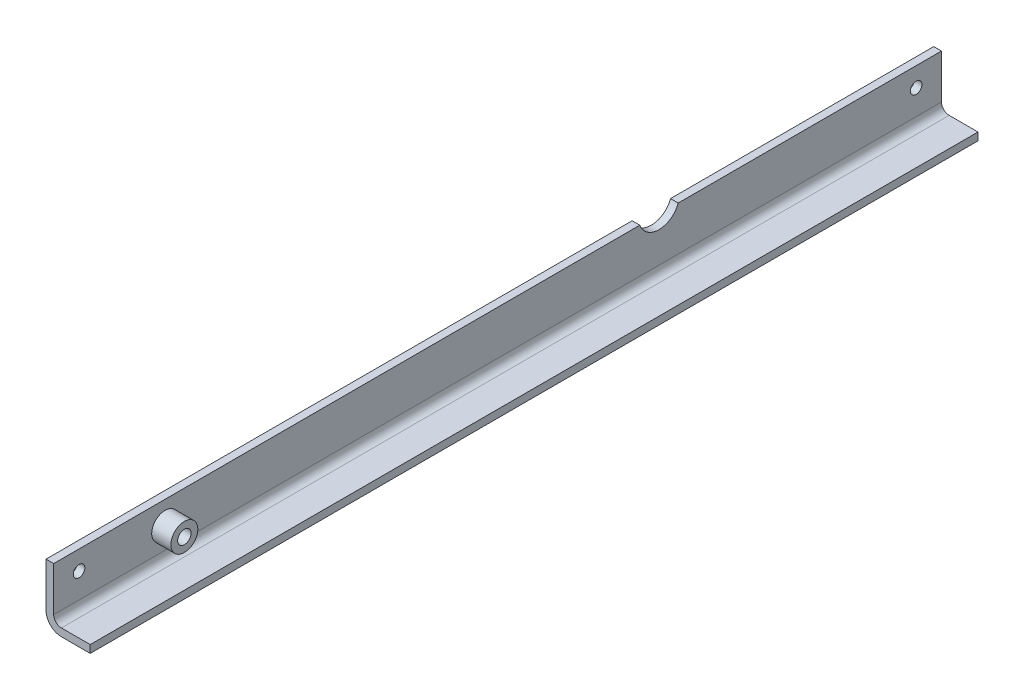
ISO-10303-21;
HEADER;
FILE_DESCRIPTION(('STEP AP214'),'2;1');
FILE_NAME('part.step','',(''),(''),'','','');
FILE_SCHEMA(('AUTOMOTIVE_DESIGN { 1 0 10303 214 1 1 1 1 }'));
ENDSEC;
DATA;
#1=APPLICATION_CONTEXT('core data for automotive mechanical design processes');
#2=APPLICATION_PROTOCOL_DEFINITION('international standard','automotive_design',2000,#1);
#3=PRODUCT_CONTEXT('',#1,'mechanical');
#4=PRODUCT('Part','Part','',(#3));
#5=PRODUCT_RELATED_PRODUCT_CATEGORY('part','',(#4));
#6=PRODUCT_DEFINITION_FORMATION('','',#4);
#7=PRODUCT_DEFINITION_CONTEXT('part definition',#1,'design');
#8=PRODUCT_DEFINITION('design','',#6,#7);
#9=PRODUCT_DEFINITION_SHAPE('','',#8);
#10=(LENGTH_UNIT() NAMED_UNIT(*) SI_UNIT(.MILLI.,.METRE.));
#11=(NAMED_UNIT(*) PLANE_ANGLE_UNIT() SI_UNIT($,.RADIAN.));
#12=(NAMED_UNIT(*) SI_UNIT($,.STERADIAN.) SOLID_ANGLE_UNIT());
#13=UNCERTAINTY_MEASURE_WITH_UNIT(LENGTH_MEASURE(1.E-05),#10,'distance_accuracy_value','');
#14=(GEOMETRIC_REPRESENTATION_CONTEXT(3) GLOBAL_UNCERTAINTY_ASSIGNED_CONTEXT((#13)) GLOBAL_UNIT_ASSIGNED_CONTEXT((#10,
#11,#12)) REPRESENTATION_CONTEXT('',''));
#15=CARTESIAN_POINT('',(0.,0.,0.));
#16=DIRECTION('',(0.,0.,1.));
#17=DIRECTION('',(1.,0.,0.));
#18=AXIS2_PLACEMENT_3D('',#15,#16,#17);
#19=CARTESIAN_POINT('',(4.00000000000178,8.00000000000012,-461.999999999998));
#20=DIRECTION('',(-0.999999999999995,0.,0.));
#21=DIRECTION('',(0.,0.,-0.999999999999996));
#22=AXIS2_PLACEMENT_3D('',#19,#20,#21);
#23=PLANE('',#22);
#24=DIRECTION('',(0.,0.,0.999999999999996));
#25=VECTOR('',#24,1.);
#26=CARTESIAN_POINT('',(4.00000000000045,31.0000000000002,-461.999999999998));
#27=LINE('',#26,#25);
#28=CARTESIAN_POINT('',(4.00000000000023,31.0000000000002,-304.999999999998));
#29=VERTEX_POINT('',#28);
#30=CARTESIAN_POINT('',(4.,31.,6.66133814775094E-13));
#31=VERTEX_POINT('',#30);
#32=EDGE_CURVE('E160',#29,#31,#27,.T.);
#33=ORIENTED_EDGE('',*,*,#32,.T.);
#34=DIRECTION('',(0.,1.,0.));
#35=VECTOR('',#34,1.);
#36=CARTESIAN_POINT('',(4.,7.99999999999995,8.88178419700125E-13));
#37=LINE('',#36,#35);
#38=CARTESIAN_POINT('',(4.,7.99999999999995,8.88178419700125E-13));
#39=VERTEX_POINT('',#38);
#40=EDGE_CURVE('E185',#39,#31,#37,.T.);
#41=ORIENTED_EDGE('',*,*,#40,.F.);
#42=DIRECTION('',(0.,0.,0.999999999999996));
#43=VECTOR('',#42,1.);
#44=CARTESIAN_POINT('',(4.00000000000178,8.00000000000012,-461.999999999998));
#45=LINE('',#44,#43);
#46=CARTESIAN_POINT('',(4.00000000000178,8.00000000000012,-461.999999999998));
#47=VERTEX_POINT('',#46);
#48=EDGE_CURVE('E144',#47,#39,#45,.T.);
#49=ORIENTED_EDGE('',*,*,#48,.F.);
#50=DIRECTION('',(0.,1.,0.));
#51=VECTOR('',#50,1.);
#52=CARTESIAN_POINT('',(4.00000000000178,8.00000000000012,-461.999999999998));
#53=LINE('',#52,#51);
#54=CARTESIAN_POINT('',(4.00000000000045,31.0000000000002,-461.999999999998));
#55=VERTEX_POINT('',#54);
#56=EDGE_CURVE('E130',#47,#55,#53,.T.);
#57=ORIENTED_EDGE('',*,*,#56,.T.);
#58=CARTESIAN_POINT('',(4.00000000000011,31.0000000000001,-324.999999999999));
#59=VERTEX_POINT('',#58);
#60=EDGE_CURVE('E188',#55,#59,#27,.T.);
#61=ORIENTED_EDGE('',*,*,#60,.T.);
#62=CARTESIAN_POINT('',(4.00000000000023,34.6428571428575,-314.999999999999));
#63=DIRECTION('',(-0.999999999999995,0.,0.));
#64=DIRECTION('',(0.,0.,-0.999999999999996));
#65=AXIS2_PLACEMENT_3D('',#62,#63,#64);
#66=CIRCLE('',#65,10.6428571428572);
#67=EDGE_CURVE('E227',#59,#29,#66,.T.);
#68=ORIENTED_EDGE('',*,*,#67,.T.);
#69=EDGE_LOOP('',(#33,#41,#49,#57,#61,#68));
#70=FACE_BOUND('',#69,.T.);
#71=CARTESIAN_POINT('',(4.,21.0000000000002,-448.799999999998));
#72=DIRECTION('',(-0.999999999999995,0.,0.));
#73=DIRECTION('',(0.,0.,0.999999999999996));
#74=AXIS2_PLACEMENT_3D('',#71,#72,#73);
#75=CIRCLE('',#74,2.99999999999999);
#76=CARTESIAN_POINT('',(4.,21.0000000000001,-445.799999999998));
#77=VERTEX_POINT('',#76);
#78=EDGE_CURVE('E431',#77,#77,#75,.T.);
#79=ORIENTED_EDGE('',*,*,#78,.T.);
#80=EDGE_LOOP('',(#79));
#81=FACE_BOUND('',#80,.T.);
#82=CARTESIAN_POINT('',(4.,20.9999999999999,-13.1999999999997));
#83=DIRECTION('',(-0.999999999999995,0.,0.));
#84=DIRECTION('',(0.,0.,0.999999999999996));
#85=AXIS2_PLACEMENT_3D('',#82,#83,#84);
#86=CIRCLE('',#85,3.);
#87=CARTESIAN_POINT('',(4.,20.9999999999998,-10.1999999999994));
#88=VERTEX_POINT('',#87);
#89=EDGE_CURVE('E439',#88,#88,#86,.T.);
#90=ORIENTED_EDGE('',*,*,#89,.T.);
#91=EDGE_LOOP('',(#90));
#92=FACE_BOUND('',#91,.T.);
#93=CARTESIAN_POINT('',(4.00000000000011,18.9999999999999,-57.9999999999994));
#94=DIRECTION('',(0.999999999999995,0.,0.));
#95=DIRECTION('',(0.,0.,-0.999999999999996));
#96=AXIS2_PLACEMENT_3D('',#93,#94,#95);
#97=CIRCLE('',#96,7.);
#98=CARTESIAN_POINT('',(4.00000000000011,19.,-64.9999999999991));
#99=VERTEX_POINT('',#98);
#100=EDGE_CURVE('E11',#99,#99,#97,.F.);
#101=ORIENTED_EDGE('',*,*,#100,.T.);
#102=EDGE_LOOP('',(#101));
#103=FACE_BOUND('',#102,.T.);
#104=ADVANCED_FACE('F42',(#70,#81,#92,#103),#23,.F.);
#105=CARTESIAN_POINT('',(3.33066907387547E-13,31.0000000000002,-461.999999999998));
#106=DIRECTION('',(0.,-1.,0.));
#107=DIRECTION('',(0.,0.,0.999999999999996));
#108=AXIS2_PLACEMENT_3D('',#105,#106,#107);
#109=PLANE('',#108);
#110=DIRECTION('',(0.,0.,0.999999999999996));
#111=VECTOR('',#110,1.);
#112=CARTESIAN_POINT('',(3.33066907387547E-13,31.0000000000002,-461.999999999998));
#113=LINE('',#112,#111);
#114=CARTESIAN_POINT('',(1.11022302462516E-13,31.0000000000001,-304.999999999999));
#115=VERTEX_POINT('',#114);
#116=CARTESIAN_POINT('',(0.,31.,6.66133814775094E-13));
#117=VERTEX_POINT('',#116);
#118=EDGE_CURVE('E207',#115,#117,#113,.T.);
#119=ORIENTED_EDGE('',*,*,#118,.T.);
#120=DIRECTION('',(-0.999999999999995,0.,0.));
#121=VECTOR('',#120,1.);
#122=CARTESIAN_POINT('',(0.,31.,6.66133814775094E-13));
#123=LINE('',#122,#121);
#124=EDGE_CURVE('E101',#31,#117,#123,.T.);
#125=ORIENTED_EDGE('',*,*,#124,.F.);
#126=ORIENTED_EDGE('',*,*,#32,.F.);
#127=DIRECTION('',(0.999999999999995,0.,0.));
#128=VECTOR('',#127,1.);
#129=CARTESIAN_POINT('',(1.11022302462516E-13,31.0000000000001,-304.999999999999));
#130=LINE('',#129,#128);
#131=EDGE_CURVE('E217',#115,#29,#130,.T.);
#132=ORIENTED_EDGE('',*,*,#131,.F.);
#133=EDGE_LOOP('',(#119,#125,#126,#132));
#134=FACE_BOUND('',#133,.T.);
#135=ADVANCED_FACE('F214',(#134),#109,.F.);
#136=ORIENTED_EDGE('',*,*,#60,.F.);
#137=DIRECTION('',(-0.999999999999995,0.,0.));
#138=VECTOR('',#137,1.);
#139=CARTESIAN_POINT('',(3.33066907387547E-13,31.0000000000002,-461.999999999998));
#140=LINE('',#139,#138);
#141=CARTESIAN_POINT('',(3.33066907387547E-13,31.0000000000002,-461.999999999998));
#142=VERTEX_POINT('',#141);
#143=EDGE_CURVE('E67',#55,#142,#140,.T.);
#144=ORIENTED_EDGE('',*,*,#143,.T.);
#145=CARTESIAN_POINT('',(1.11022302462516E-13,31.0000000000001,-324.999999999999));
#146=VERTEX_POINT('',#145);
#147=EDGE_CURVE('E51',#142,#146,#113,.T.);
#148=ORIENTED_EDGE('',*,*,#147,.T.);
#149=DIRECTION('',(0.999999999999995,0.,0.));
#150=VECTOR('',#149,1.);
#151=CARTESIAN_POINT('',(1.11022302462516E-13,31.0000000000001,-324.999999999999));
#152=LINE('',#151,#150);
#153=EDGE_CURVE('E58',#146,#59,#152,.T.);
#154=ORIENTED_EDGE('',*,*,#153,.T.);
#155=EDGE_LOOP('',(#136,#144,#148,#154));
#156=FACE_BOUND('',#155,.T.);
#157=ADVANCED_FACE('F44',(#156),#109,.F.);
#158=CARTESIAN_POINT('',(1.66533453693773E-12,8.00000000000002,-461.999999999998));
#159=DIRECTION('',(0.999999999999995,0.,0.));
#160=DIRECTION('',(0.,0.,0.999999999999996));
#161=AXIS2_PLACEMENT_3D('',#158,#159,#160);
#162=PLANE('',#161);
#163=CARTESIAN_POINT('',(0.,19.,-57.9999999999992));
#164=DIRECTION('',(-0.999999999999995,0.,0.));
#165=DIRECTION('',(0.,0.,0.999999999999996));
#166=AXIS2_PLACEMENT_3D('',#163,#164,#165);
#167=CIRCLE('',#166,3.5);
#168=CARTESIAN_POINT('',(0.,19.,-54.4999999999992));
#169=VERTEX_POINT('',#168);
#170=EDGE_CURVE('E443',#169,#169,#167,.T.);
#171=ORIENTED_EDGE('',*,*,#170,.F.);
#172=EDGE_LOOP('',(#171));
#173=FACE_BOUND('',#172,.T.);
#174=CARTESIAN_POINT('',(0.,20.9999999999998,-13.1999999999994));
#175=DIRECTION('',(-0.999999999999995,0.,0.));
#176=DIRECTION('',(0.,0.,0.999999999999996));
#177=AXIS2_PLACEMENT_3D('',#174,#175,#176);
#178=CIRCLE('',#177,3.);
#179=CARTESIAN_POINT('',(0.,20.9999999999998,-10.1999999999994));
#180=VERTEX_POINT('',#179);
#181=EDGE_CURVE('E435',#180,#180,#178,.T.);
#182=ORIENTED_EDGE('',*,*,#181,.F.);
#183=EDGE_LOOP('',(#182));
#184=FACE_BOUND('',#183,.T.);
#185=CARTESIAN_POINT('',(0.,21.0000000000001,-448.799999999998));
#186=DIRECTION('',(-0.999999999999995,0.,0.));
#187=DIRECTION('',(0.,0.,0.999999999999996));
#188=AXIS2_PLACEMENT_3D('',#185,#186,#187);
#189=CIRCLE('',#188,2.99999999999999);
#190=CARTESIAN_POINT('',(0.,21.0000000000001,-445.799999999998));
#191=VERTEX_POINT('',#190);
#192=EDGE_CURVE('E164',#191,#191,#189,.T.);
#193=ORIENTED_EDGE('',*,*,#192,.F.);
#194=EDGE_LOOP('',(#193));
#195=FACE_BOUND('',#194,.T.);
#196=ORIENTED_EDGE('',*,*,#147,.F.);
#197=DIRECTION('',(0.,-1.,0.));
#198=VECTOR('',#197,1.);
#199=CARTESIAN_POINT('',(1.66533453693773E-12,8.00000000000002,-461.999999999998));
#200=LINE('',#199,#198);
#201=CARTESIAN_POINT('',(1.66533453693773E-12,8.00000000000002,-461.999999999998));
#202=VERTEX_POINT('',#201);
#203=EDGE_CURVE('E107',#142,#202,#200,.T.);
#204=ORIENTED_EDGE('',*,*,#203,.T.);
#205=DIRECTION('',(0.,0.,0.999999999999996));
#206=VECTOR('',#205,1.);
#207=CARTESIAN_POINT('',(1.66533453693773E-12,8.00000000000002,-461.999999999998));
#208=LINE('',#207,#206);
#209=CARTESIAN_POINT('',(0.,7.99999999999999,1.11022302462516E-12));
#210=VERTEX_POINT('',#209);
#211=EDGE_CURVE('E204',#202,#210,#208,.T.);
#212=ORIENTED_EDGE('',*,*,#211,.T.);
#213=DIRECTION('',(0.,-1.,0.));
#214=VECTOR('',#213,1.);
#215=CARTESIAN_POINT('',(0.,7.99999999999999,1.11022302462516E-12));
#216=LINE('',#215,#214);
#217=EDGE_CURVE('E163',#117,#210,#216,.T.);
#218=ORIENTED_EDGE('',*,*,#217,.F.);
#219=ORIENTED_EDGE('',*,*,#118,.F.);
#220=CARTESIAN_POINT('',(0.,34.6428571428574,-314.999999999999));
#221=DIRECTION('',(-0.999999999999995,0.,0.));
#222=DIRECTION('',(0.,0.,-0.999999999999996));
#223=AXIS2_PLACEMENT_3D('',#220,#221,#222);
#224=CIRCLE('',#223,10.6428571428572);
#225=EDGE_CURVE('E222',#146,#115,#224,.T.);
#226=ORIENTED_EDGE('',*,*,#225,.F.);
#227=EDGE_LOOP('',(#196,#204,#212,#218,#219,#226));
#228=FACE_BOUND('',#227,.T.);
#229=ADVANCED_FACE('F220',(#173,#184,#195,#228),#162,.F.);
#230=CARTESIAN_POINT('',(8.00000000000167,8.0000000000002,-461.999999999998));
#231=DIRECTION('',(0.,0.,0.999999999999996));
#232=DIRECTION('',(-0.999999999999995,0.,0.));
#233=AXIS2_PLACEMENT_3D('',#230,#231,#232);
#234=CYLINDRICAL_SURFACE('',#233,8.);
#235=CARTESIAN_POINT('',(8.00000000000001,7.99999999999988,4.44089209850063E-13));
#236=DIRECTION('',(0.,0.,0.999999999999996));
#237=DIRECTION('',(-0.999999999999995,0.,0.));
#238=AXIS2_PLACEMENT_3D('',#235,#236,#237);
#239=CIRCLE('',#238,8.);
#240=CARTESIAN_POINT('',(7.99999999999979,0.,0.));
#241=VERTEX_POINT('',#240);
#242=EDGE_CURVE('E168',#210,#241,#239,.T.);
#243=ORIENTED_EDGE('',*,*,#242,.F.);
#244=ORIENTED_EDGE('',*,*,#211,.F.);
#245=CARTESIAN_POINT('',(8.00000000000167,8.0000000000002,-461.999999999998));
#246=DIRECTION('',(0.,0.,0.999999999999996));
#247=DIRECTION('',(-0.999999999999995,0.,0.));
#248=AXIS2_PLACEMENT_3D('',#245,#246,#247);
#249=CIRCLE('',#248,8.);
#250=CARTESIAN_POINT('',(8.00000000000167,2.77555756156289E-13,-461.999999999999));
#251=VERTEX_POINT('',#250);
#252=EDGE_CURVE('E421',#202,#251,#249,.T.);
#253=ORIENTED_EDGE('',*,*,#252,.T.);
#254=DIRECTION('',(0.,0.,0.999999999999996));
#255=VECTOR('',#254,1.);
#256=CARTESIAN_POINT('',(8.00000000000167,2.77555756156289E-13,-461.999999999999));
#257=LINE('',#256,#255);
#258=EDGE_CURVE('E200',#251,#241,#257,.T.);
#259=ORIENTED_EDGE('',*,*,#258,.T.);
#260=EDGE_LOOP('',(#243,#244,#253,#259));
#261=FACE_BOUND('',#260,.T.);
#262=ADVANCED_FACE('F274',(#261),#234,.T.);
#263=CARTESIAN_POINT('',(8.00000000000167,2.77555756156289E-13,-461.999999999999));
#264=DIRECTION('',(0.,1.,0.));
#265=DIRECTION('',(0.,0.,-0.999999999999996));
#266=AXIS2_PLACEMENT_3D('',#263,#264,#265);
#267=PLANE('',#266);
#268=DIRECTION('',(0.999999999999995,0.,0.));
#269=VECTOR('',#268,1.);
#270=CARTESIAN_POINT('',(7.99999999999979,0.,0.));
#271=LINE('',#270,#269);
#272=CARTESIAN_POINT('',(22.9999999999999,2.35922392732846E-13,6.66133814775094E-13));
#273=VERTEX_POINT('',#272);
#274=EDGE_CURVE('E172',#241,#273,#271,.T.);
#275=ORIENTED_EDGE('',*,*,#274,.F.);
#276=ORIENTED_EDGE('',*,*,#258,.F.);
#277=DIRECTION('',(0.999999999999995,0.,0.));
#278=VECTOR('',#277,1.);
#279=CARTESIAN_POINT('',(8.00000000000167,2.77555756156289E-13,-461.999999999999));
#280=LINE('',#279,#278);
#281=CARTESIAN_POINT('',(23.0000000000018,0.,-461.999999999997));
#282=VERTEX_POINT('',#281);
#283=EDGE_CURVE('E154',#251,#282,#280,.T.);
#284=ORIENTED_EDGE('',*,*,#283,.T.);
#285=DIRECTION('',(0.,0.,0.999999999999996));
#286=VECTOR('',#285,1.);
#287=CARTESIAN_POINT('',(23.0000000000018,0.,-461.999999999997));
#288=LINE('',#287,#286);
#289=EDGE_CURVE('E196',#282,#273,#288,.T.);
#290=ORIENTED_EDGE('',*,*,#289,.T.);
#291=EDGE_LOOP('',(#275,#276,#284,#290));
#292=FACE_BOUND('',#291,.T.);
#293=ADVANCED_FACE('F286',(#292),#267,.F.);
#294=CARTESIAN_POINT('',(23.0000000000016,4.00000000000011,-461.999999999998));
#295=DIRECTION('',(-0.999999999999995,0.,0.));
#296=DIRECTION('',(0.,0.,-0.999999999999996));
#297=AXIS2_PLACEMENT_3D('',#294,#295,#296);
#298=PLANE('',#297);
#299=DIRECTION('',(0.,1.,0.));
#300=VECTOR('',#299,1.);
#301=CARTESIAN_POINT('',(22.9999999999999,4.00000000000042,6.66133814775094E-13));
#302=LINE('',#301,#300);
#303=CARTESIAN_POINT('',(22.9999999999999,4.00000000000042,6.66133814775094E-13));
#304=VERTEX_POINT('',#303);
#305=EDGE_CURVE('E176',#273,#304,#302,.T.);
#306=ORIENTED_EDGE('',*,*,#305,.F.);
#307=ORIENTED_EDGE('',*,*,#289,.F.);
#308=DIRECTION('',(0.,1.,0.));
#309=VECTOR('',#308,1.);
#310=CARTESIAN_POINT('',(23.0000000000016,4.00000000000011,-461.999999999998));
#311=LINE('',#310,#309);
#312=CARTESIAN_POINT('',(23.0000000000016,4.00000000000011,-461.999999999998));
#313=VERTEX_POINT('',#312);
#314=EDGE_CURVE('E150',#282,#313,#311,.T.);
#315=ORIENTED_EDGE('',*,*,#314,.T.);
#316=DIRECTION('',(0.,0.,0.999999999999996));
#317=VECTOR('',#316,1.);
#318=CARTESIAN_POINT('',(23.0000000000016,4.00000000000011,-461.999999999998));
#319=LINE('',#318,#317);
#320=EDGE_CURVE('E143',#313,#304,#319,.T.);
#321=ORIENTED_EDGE('',*,*,#320,.T.);
#322=EDGE_LOOP('',(#306,#307,#315,#321));
#323=FACE_BOUND('',#322,.T.);
#324=ADVANCED_FACE('F294',(#323),#298,.F.);
#325=CARTESIAN_POINT('',(8.00000000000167,4.00000000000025,-461.999999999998));
#326=DIRECTION('',(0.,-1.,0.));
#327=DIRECTION('',(0.,0.,0.999999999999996));
#328=AXIS2_PLACEMENT_3D('',#325,#326,#327);
#329=PLANE('',#328);
#330=DIRECTION('',(-0.999999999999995,0.,0.));
#331=VECTOR('',#330,1.);
#332=CARTESIAN_POINT('',(8.00000000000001,3.99999999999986,-2.22044604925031E-13));
#333=LINE('',#332,#331);
#334=CARTESIAN_POINT('',(8.00000000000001,3.99999999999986,-2.22044604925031E-13));
#335=VERTEX_POINT('',#334);
#336=EDGE_CURVE('E180',#304,#335,#333,.T.);
#337=ORIENTED_EDGE('',*,*,#336,.F.);
#338=ORIENTED_EDGE('',*,*,#320,.F.);
#339=DIRECTION('',(-0.999999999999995,0.,0.));
#340=VECTOR('',#339,1.);
#341=CARTESIAN_POINT('',(8.00000000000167,4.00000000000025,-461.999999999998));
#342=LINE('',#341,#340);
#343=CARTESIAN_POINT('',(8.00000000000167,4.00000000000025,-461.999999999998));
#344=VERTEX_POINT('',#343);
#345=EDGE_CURVE('E127',#313,#344,#342,.T.);
#346=ORIENTED_EDGE('',*,*,#345,.T.);
#347=DIRECTION('',(0.,0.,0.999999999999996));
#348=VECTOR('',#347,1.);
#349=CARTESIAN_POINT('',(8.00000000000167,4.00000000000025,-461.999999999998));
#350=LINE('',#349,#348);
#351=EDGE_CURVE('E137',#344,#335,#350,.T.);
#352=ORIENTED_EDGE('',*,*,#351,.T.);
#353=EDGE_LOOP('',(#337,#338,#346,#352));
#354=FACE_BOUND('',#353,.T.);
#355=ADVANCED_FACE('F146',(#354),#329,.F.);
#356=CARTESIAN_POINT('',(8.00000000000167,8.0000000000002,-461.999999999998));
#357=DIRECTION('',(0.,0.,0.999999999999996));
#358=DIRECTION('',(-0.999999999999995,0.,0.));
#359=AXIS2_PLACEMENT_3D('',#356,#357,#358);
#360=CYLINDRICAL_SURFACE('',#359,4.);
#361=CARTESIAN_POINT('',(8.00000000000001,7.99999999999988,4.44089209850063E-13));
#362=DIRECTION('',(0.,0.,-0.999999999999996));
#363=DIRECTION('',(0.999999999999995,0.,0.));
#364=AXIS2_PLACEMENT_3D('',#361,#362,#363);
#365=CIRCLE('',#364,4.);
#366=EDGE_CURVE('E139',#335,#39,#365,.T.);
#367=ORIENTED_EDGE('',*,*,#366,.F.);
#368=ORIENTED_EDGE('',*,*,#351,.F.);
#369=CARTESIAN_POINT('',(8.00000000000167,8.0000000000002,-461.999999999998));
#370=DIRECTION('',(0.,0.,-0.999999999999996));
#371=DIRECTION('',(0.999999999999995,0.,0.));
#372=AXIS2_PLACEMENT_3D('',#369,#370,#371);
#373=CIRCLE('',#372,4.);
#374=EDGE_CURVE('E123',#344,#47,#373,.T.);
#375=ORIENTED_EDGE('',*,*,#374,.T.);
#376=ORIENTED_EDGE('',*,*,#48,.T.);
#377=EDGE_LOOP('',(#367,#368,#375,#376));
#378=FACE_BOUND('',#377,.T.);
#379=ADVANCED_FACE('F138',(#378),#360,.F.);
#380=CARTESIAN_POINT('',(8.00000000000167,8.0000000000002,-461.999999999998));
#381=DIRECTION('',(0.,0.,-0.999999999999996));
#382=DIRECTION('',(0.999999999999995,0.,0.));
#383=AXIS2_PLACEMENT_3D('',#380,#381,#382);
#384=PLANE('',#383);
#385=ORIENTED_EDGE('',*,*,#143,.F.);
#386=ORIENTED_EDGE('',*,*,#56,.F.);
#387=ORIENTED_EDGE('',*,*,#374,.F.);
#388=ORIENTED_EDGE('',*,*,#345,.F.);
#389=ORIENTED_EDGE('',*,*,#314,.F.);
#390=ORIENTED_EDGE('',*,*,#283,.F.);
#391=ORIENTED_EDGE('',*,*,#252,.F.);
#392=ORIENTED_EDGE('',*,*,#203,.F.);
#393=EDGE_LOOP('',(#385,#386,#387,#388,#389,#390,#391,#392));
#394=FACE_BOUND('',#393,.T.);
#395=ADVANCED_FACE('F125',(#394),#384,.T.);
#396=CARTESIAN_POINT('',(8.00000000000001,7.99999999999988,4.44089209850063E-13));
#397=DIRECTION('',(0.,0.,-0.999999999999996));
#398=DIRECTION('',(0.999999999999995,0.,0.));
#399=AXIS2_PLACEMENT_3D('',#396,#397,#398);
#400=PLANE('',#399);
#401=ORIENTED_EDGE('',*,*,#124,.T.);
#402=ORIENTED_EDGE('',*,*,#217,.T.);
#403=ORIENTED_EDGE('',*,*,#242,.T.);
#404=ORIENTED_EDGE('',*,*,#274,.T.);
#405=ORIENTED_EDGE('',*,*,#305,.T.);
#406=ORIENTED_EDGE('',*,*,#336,.T.);
#407=ORIENTED_EDGE('',*,*,#366,.T.);
#408=ORIENTED_EDGE('',*,*,#40,.T.);
#409=EDGE_LOOP('',(#401,#402,#403,#404,#405,#406,#407,#408));
#410=FACE_BOUND('',#409,.T.);
#411=ADVANCED_FACE('F321',(#410),#400,.F.);
#412=CARTESIAN_POINT('',(0.,21.0000000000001,-448.799999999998));
#413=DIRECTION('',(0.999999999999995,0.,0.));
#414=DIRECTION('',(0.,0.,0.999999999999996));
#415=AXIS2_PLACEMENT_3D('',#412,#413,#414);
#416=CYLINDRICAL_SURFACE('',#415,2.99999999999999);
#417=CARTESIAN_POINT('',(0.,21.0000000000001,-445.799999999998));
#418=CARTESIAN_POINT('',(0.041666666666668,21.0000000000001,-445.799999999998));
#419=CARTESIAN_POINT('',(0.0833333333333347,21.0000000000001,-445.799999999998));
#420=CARTESIAN_POINT('',(0.166666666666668,21.0000000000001,-445.799999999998));
#421=CARTESIAN_POINT('',(0.208333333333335,21.0000000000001,-445.799999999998));
#422=CARTESIAN_POINT('',(0.291666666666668,21.0000000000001,-445.799999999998));
#423=CARTESIAN_POINT('',(0.333333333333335,21.0000000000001,-445.799999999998));
#424=CARTESIAN_POINT('',(0.416666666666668,21.0000000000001,-445.799999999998));
#425=CARTESIAN_POINT('',(0.458333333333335,21.0000000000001,-445.799999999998));
#426=CARTESIAN_POINT('',(0.541666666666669,21.0000000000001,-445.799999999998));
#427=CARTESIAN_POINT('',(0.583333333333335,21.0000000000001,-445.799999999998));
#428=CARTESIAN_POINT('',(0.666666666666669,21.0000000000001,-445.799999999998));
#429=CARTESIAN_POINT('',(0.708333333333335,21.0000000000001,-445.799999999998));
#430=CARTESIAN_POINT('',(0.791666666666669,21.0000000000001,-445.799999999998));
#431=CARTESIAN_POINT('',(0.833333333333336,21.0000000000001,-445.799999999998));
#432=CARTESIAN_POINT('',(0.916666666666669,21.0000000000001,-445.799999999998));
#433=CARTESIAN_POINT('',(0.958333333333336,21.0000000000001,-445.799999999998));
#434=CARTESIAN_POINT('',(1.04166666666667,21.0000000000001,-445.799999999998));
#435=CARTESIAN_POINT('',(1.08333333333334,21.0000000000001,-445.799999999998));
#436=CARTESIAN_POINT('',(1.16666666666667,21.0000000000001,-445.799999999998));
#437=CARTESIAN_POINT('',(1.20833333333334,21.0000000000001,-445.799999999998));
#438=CARTESIAN_POINT('',(1.29166666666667,21.0000000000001,-445.799999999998));
#439=CARTESIAN_POINT('',(1.33333333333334,21.0000000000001,-445.799999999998));
#440=CARTESIAN_POINT('',(1.41666666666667,21.0000000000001,-445.799999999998));
#441=CARTESIAN_POINT('',(1.45833333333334,21.0000000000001,-445.799999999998));
#442=CARTESIAN_POINT('',(1.54166666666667,21.0000000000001,-445.799999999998));
#443=CARTESIAN_POINT('',(1.58333333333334,21.0000000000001,-445.799999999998));
#444=CARTESIAN_POINT('',(1.66666666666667,21.0000000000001,-445.799999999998));
#445=CARTESIAN_POINT('',(1.70833333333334,21.0000000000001,-445.799999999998));
#446=CARTESIAN_POINT('',(1.79166666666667,21.0000000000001,-445.799999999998));
#447=CARTESIAN_POINT('',(1.83333333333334,21.0000000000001,-445.799999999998));
#448=CARTESIAN_POINT('',(1.91666666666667,21.0000000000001,-445.799999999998));
#449=CARTESIAN_POINT('',(1.95833333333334,21.0000000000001,-445.799999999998));
#450=CARTESIAN_POINT('',(2.04166666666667,21.0000000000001,-445.799999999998));
#451=CARTESIAN_POINT('',(2.08333333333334,21.0000000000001,-445.799999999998));
#452=CARTESIAN_POINT('',(2.16666666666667,21.0000000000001,-445.799999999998));
#453=CARTESIAN_POINT('',(2.20833333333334,21.0000000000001,-445.799999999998));
#454=CARTESIAN_POINT('',(2.29166666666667,21.0000000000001,-445.799999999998));
#455=CARTESIAN_POINT('',(2.33333333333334,21.0000000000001,-445.799999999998));
#456=CARTESIAN_POINT('',(2.41666666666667,21.0000000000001,-445.799999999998));
#457=CARTESIAN_POINT('',(2.45833333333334,21.0000000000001,-445.799999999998));
#458=CARTESIAN_POINT('',(2.54166666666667,21.0000000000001,-445.799999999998));
#459=CARTESIAN_POINT('',(2.58333333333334,21.0000000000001,-445.799999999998));
#460=CARTESIAN_POINT('',(2.66666666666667,21.0000000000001,-445.799999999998));
#461=CARTESIAN_POINT('',(2.70833333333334,21.0000000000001,-445.799999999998));
#462=CARTESIAN_POINT('',(2.79166666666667,21.0000000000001,-445.799999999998));
#463=CARTESIAN_POINT('',(2.83333333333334,21.0000000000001,-445.799999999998));
#464=CARTESIAN_POINT('',(2.91666666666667,21.0000000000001,-445.799999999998));
#465=CARTESIAN_POINT('',(2.95833333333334,21.0000000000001,-445.799999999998));
#466=CARTESIAN_POINT('',(3.04166666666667,21.0000000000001,-445.799999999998));
#467=CARTESIAN_POINT('',(3.08333333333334,21.0000000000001,-445.799999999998));
#468=CARTESIAN_POINT('',(3.16666666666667,21.0000000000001,-445.799999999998));
#469=CARTESIAN_POINT('',(3.20833333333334,21.0000000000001,-445.799999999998));
#470=CARTESIAN_POINT('',(3.29166666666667,21.0000000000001,-445.799999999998));
#471=CARTESIAN_POINT('',(3.33333333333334,21.0000000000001,-445.799999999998));
#472=CARTESIAN_POINT('',(3.41666666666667,21.0000000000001,-445.799999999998));
#473=CARTESIAN_POINT('',(3.45833333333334,21.0000000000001,-445.799999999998));
#474=CARTESIAN_POINT('',(3.54166666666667,21.0000000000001,-445.799999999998));
#475=CARTESIAN_POINT('',(3.58333333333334,21.0000000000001,-445.799999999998));
#476=CARTESIAN_POINT('',(3.66666666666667,21.0000000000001,-445.799999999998));
#477=CARTESIAN_POINT('',(3.70833333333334,21.0000000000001,-445.799999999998));
#478=CARTESIAN_POINT('',(3.79166666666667,21.0000000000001,-445.799999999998));
#479=CARTESIAN_POINT('',(3.83333333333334,21.0000000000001,-445.799999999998));
#480=CARTESIAN_POINT('',(3.91666666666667,21.0000000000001,-445.799999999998));
#481=CARTESIAN_POINT('',(3.95833333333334,21.0000000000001,-445.799999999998));
#482=CARTESIAN_POINT('',(4.,21.0000000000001,-445.799999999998));
#483=B_SPLINE_CURVE_WITH_KNOTS('',3,(#417,#418,#419,#420,#421,#422,#423,#424,#425,#426,#427,
#428,#429,#430,#431,#432,#433,#434,#435,#436,#437,#438,#439,#440,#441,#442,#443,#444,#445,#446,
#447,#448,#449,#450,#451,#452,#453,#454,#455,#456,#457,#458,#459,#460,#461,#462,#463,#464,#465,
#466,#467,#468,#469,#470,#471,#472,#473,#474,#475,#476,#477,#478,#479,#480,#481,#482),
.UNSPECIFIED.,.F.,.F.,(4,2,2,2,2,2,2,2,2,2,2,2,2,2,2,2,2,2,2,2,2,2,2,2,2,2,2,2,2,2,2,2,4),(0.,
0.125,0.25,0.375,0.500000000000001,0.625000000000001,0.750000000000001,0.875000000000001,1.,
1.125,1.25,1.375,1.5,1.625,1.75,1.875,2.,2.125,2.25,2.375,2.5,2.625,2.75,2.875,3.,3.125,3.25,
3.375,3.5,3.625,3.75,3.875,4.),.UNSPECIFIED.);
#484=EDGE_CURVE('BSEAM328',#191,#77,#483,.T.);
#485=ORIENTED_EDGE('',*,*,#192,.T.);
#486=ORIENTED_EDGE('',*,*,#78,.F.);
#487=ORIENTED_EDGE('',*,*,#484,.T.);
#488=ORIENTED_EDGE('',*,*,#484,.F.);
#489=EDGE_LOOP('',(#485,#487,#486,#488));
#490=FACE_BOUND('',#489,.T.);
#491=ADVANCED_FACE('F328',(#490),#416,.F.);
#492=CARTESIAN_POINT('',(0.,20.9999999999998,-13.1999999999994));
#493=DIRECTION('',(0.999999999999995,0.,0.));
#494=DIRECTION('',(0.,0.,0.999999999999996));
#495=AXIS2_PLACEMENT_3D('',#492,#493,#494);
#496=CYLINDRICAL_SURFACE('',#495,3.);
#497=CARTESIAN_POINT('',(0.,20.9999999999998,-10.1999999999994));
#498=CARTESIAN_POINT('',(0.041666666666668,20.9999999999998,-10.1999999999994));
#499=CARTESIAN_POINT('',(0.0833333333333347,20.9999999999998,-10.1999999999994));
#500=CARTESIAN_POINT('',(0.166666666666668,20.9999999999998,-10.1999999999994));
#501=CARTESIAN_POINT('',(0.208333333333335,20.9999999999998,-10.1999999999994));
#502=CARTESIAN_POINT('',(0.291666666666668,20.9999999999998,-10.1999999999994));
#503=CARTESIAN_POINT('',(0.333333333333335,20.9999999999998,-10.1999999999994));
#504=CARTESIAN_POINT('',(0.416666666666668,20.9999999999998,-10.1999999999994));
#505=CARTESIAN_POINT('',(0.458333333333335,20.9999999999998,-10.1999999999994));
#506=CARTESIAN_POINT('',(0.541666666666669,20.9999999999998,-10.1999999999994));
#507=CARTESIAN_POINT('',(0.583333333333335,20.9999999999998,-10.1999999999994));
#508=CARTESIAN_POINT('',(0.666666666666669,20.9999999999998,-10.1999999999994));
#509=CARTESIAN_POINT('',(0.708333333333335,20.9999999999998,-10.1999999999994));
#510=CARTESIAN_POINT('',(0.791666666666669,20.9999999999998,-10.1999999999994));
#511=CARTESIAN_POINT('',(0.833333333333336,20.9999999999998,-10.1999999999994));
#512=CARTESIAN_POINT('',(0.916666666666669,20.9999999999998,-10.1999999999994));
#513=CARTESIAN_POINT('',(0.958333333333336,20.9999999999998,-10.1999999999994));
#514=CARTESIAN_POINT('',(1.04166666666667,20.9999999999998,-10.1999999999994));
#515=CARTESIAN_POINT('',(1.08333333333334,20.9999999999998,-10.1999999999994));
#516=CARTESIAN_POINT('',(1.16666666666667,20.9999999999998,-10.1999999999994));
#517=CARTESIAN_POINT('',(1.20833333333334,20.9999999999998,-10.1999999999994));
#518=CARTESIAN_POINT('',(1.29166666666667,20.9999999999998,-10.1999999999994));
#519=CARTESIAN_POINT('',(1.33333333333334,20.9999999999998,-10.1999999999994));
#520=CARTESIAN_POINT('',(1.41666666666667,20.9999999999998,-10.1999999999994));
#521=CARTESIAN_POINT('',(1.45833333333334,20.9999999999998,-10.1999999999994));
#522=CARTESIAN_POINT('',(1.54166666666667,20.9999999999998,-10.1999999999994));
#523=CARTESIAN_POINT('',(1.58333333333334,20.9999999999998,-10.1999999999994));
#524=CARTESIAN_POINT('',(1.66666666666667,20.9999999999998,-10.1999999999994));
#525=CARTESIAN_POINT('',(1.70833333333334,20.9999999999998,-10.1999999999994));
#526=CARTESIAN_POINT('',(1.79166666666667,20.9999999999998,-10.1999999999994));
#527=CARTESIAN_POINT('',(1.83333333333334,20.9999999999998,-10.1999999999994));
#528=CARTESIAN_POINT('',(1.91666666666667,20.9999999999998,-10.1999999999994));
#529=CARTESIAN_POINT('',(1.95833333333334,20.9999999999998,-10.1999999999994));
#530=CARTESIAN_POINT('',(2.04166666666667,20.9999999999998,-10.1999999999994));
#531=CARTESIAN_POINT('',(2.08333333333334,20.9999999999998,-10.1999999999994));
#532=CARTESIAN_POINT('',(2.16666666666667,20.9999999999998,-10.1999999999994));
#533=CARTESIAN_POINT('',(2.20833333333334,20.9999999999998,-10.1999999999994));
#534=CARTESIAN_POINT('',(2.29166666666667,20.9999999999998,-10.1999999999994));
#535=CARTESIAN_POINT('',(2.33333333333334,20.9999999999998,-10.1999999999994));
#536=CARTESIAN_POINT('',(2.41666666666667,20.9999999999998,-10.1999999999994));
#537=CARTESIAN_POINT('',(2.45833333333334,20.9999999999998,-10.1999999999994));
#538=CARTESIAN_POINT('',(2.54166666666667,20.9999999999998,-10.1999999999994));
#539=CARTESIAN_POINT('',(2.58333333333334,20.9999999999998,-10.1999999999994));
#540=CARTESIAN_POINT('',(2.66666666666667,20.9999999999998,-10.1999999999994));
#541=CARTESIAN_POINT('',(2.70833333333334,20.9999999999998,-10.1999999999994));
#542=CARTESIAN_POINT('',(2.79166666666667,20.9999999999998,-10.1999999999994));
#543=CARTESIAN_POINT('',(2.83333333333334,20.9999999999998,-10.1999999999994));
#544=CARTESIAN_POINT('',(2.91666666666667,20.9999999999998,-10.1999999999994));
#545=CARTESIAN_POINT('',(2.95833333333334,20.9999999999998,-10.1999999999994));
#546=CARTESIAN_POINT('',(3.04166666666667,20.9999999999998,-10.1999999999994));
#547=CARTESIAN_POINT('',(3.08333333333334,20.9999999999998,-10.1999999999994));
#548=CARTESIAN_POINT('',(3.16666666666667,20.9999999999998,-10.1999999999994));
#549=CARTESIAN_POINT('',(3.20833333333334,20.9999999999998,-10.1999999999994));
#550=CARTESIAN_POINT('',(3.29166666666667,20.9999999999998,-10.1999999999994));
#551=CARTESIAN_POINT('',(3.33333333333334,20.9999999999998,-10.1999999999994));
#552=CARTESIAN_POINT('',(3.41666666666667,20.9999999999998,-10.1999999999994));
#553=CARTESIAN_POINT('',(3.45833333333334,20.9999999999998,-10.1999999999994));
#554=CARTESIAN_POINT('',(3.54166666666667,20.9999999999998,-10.1999999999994));
#555=CARTESIAN_POINT('',(3.58333333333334,20.9999999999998,-10.1999999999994));
#556=CARTESIAN_POINT('',(3.66666666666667,20.9999999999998,-10.1999999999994));
#557=CARTESIAN_POINT('',(3.70833333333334,20.9999999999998,-10.1999999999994));
#558=CARTESIAN_POINT('',(3.79166666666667,20.9999999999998,-10.1999999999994));
#559=CARTESIAN_POINT('',(3.83333333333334,20.9999999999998,-10.1999999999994));
#560=CARTESIAN_POINT('',(3.91666666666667,20.9999999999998,-10.1999999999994));
#561=CARTESIAN_POINT('',(3.95833333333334,20.9999999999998,-10.1999999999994));
#562=CARTESIAN_POINT('',(4.,20.9999999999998,-10.1999999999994));
#563=B_SPLINE_CURVE_WITH_KNOTS('',3,(#497,#498,#499,#500,#501,#502,#503,#504,#505,#506,#507,
#508,#509,#510,#511,#512,#513,#514,#515,#516,#517,#518,#519,#520,#521,#522,#523,#524,#525,#526,
#527,#528,#529,#530,#531,#532,#533,#534,#535,#536,#537,#538,#539,#540,#541,#542,#543,#544,#545,
#546,#547,#548,#549,#550,#551,#552,#553,#554,#555,#556,#557,#558,#559,#560,#561,#562),
.UNSPECIFIED.,.F.,.F.,(4,2,2,2,2,2,2,2,2,2,2,2,2,2,2,2,2,2,2,2,2,2,2,2,2,2,2,2,2,2,2,2,4),(0.,
0.125,0.25,0.375,0.500000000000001,0.625000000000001,0.750000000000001,0.875000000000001,1.,
1.125,1.25,1.375,1.5,1.625,1.75,1.875,2.,2.125,2.25,2.375,2.5,2.625,2.75,2.875,3.,3.125,3.25,
3.375,3.5,3.625,3.75,3.875,4.),.UNSPECIFIED.);
#564=EDGE_CURVE('BSEAM336',#180,#88,#563,.T.);
#565=ORIENTED_EDGE('',*,*,#181,.T.);
#566=ORIENTED_EDGE('',*,*,#89,.F.);
#567=ORIENTED_EDGE('',*,*,#564,.T.);
#568=ORIENTED_EDGE('',*,*,#564,.F.);
#569=EDGE_LOOP('',(#565,#567,#566,#568));
#570=FACE_BOUND('',#569,.T.);
#571=ADVANCED_FACE('F336',(#570),#496,.F.);
#572=CARTESIAN_POINT('',(0.,19.,-57.9999999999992));
#573=DIRECTION('',(0.999999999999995,0.,0.));
#574=DIRECTION('',(0.,0.,0.999999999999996));
#575=AXIS2_PLACEMENT_3D('',#572,#573,#574);
#576=CYLINDRICAL_SURFACE('',#575,3.5);
#577=CARTESIAN_POINT('',(14.,18.9999999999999,-57.9999999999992));
#578=DIRECTION('',(-0.999999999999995,0.,0.));
#579=DIRECTION('',(0.,0.,0.999999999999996));
#580=AXIS2_PLACEMENT_3D('',#577,#578,#579);
#581=CIRCLE('',#580,3.5);
#582=CARTESIAN_POINT('',(14.,19.,-54.4999999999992));
#583=VERTEX_POINT('',#582);
#584=EDGE_CURVE('E457',#583,#583,#581,.T.);
#585=CARTESIAN_POINT('',(0.,19.,-54.4999999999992));
#586=CARTESIAN_POINT('',(0.145833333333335,19.,-54.4999999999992));
#587=CARTESIAN_POINT('',(0.291666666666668,19.,-54.4999999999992));
#588=CARTESIAN_POINT('',(0.583333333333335,19.,-54.4999999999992));
#589=CARTESIAN_POINT('',(0.729166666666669,19.,-54.4999999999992));
#590=CARTESIAN_POINT('',(1.02083333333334,19.,-54.4999999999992));
#591=CARTESIAN_POINT('',(1.16666666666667,19.,-54.4999999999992));
#592=CARTESIAN_POINT('',(1.45833333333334,19.,-54.4999999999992));
#593=CARTESIAN_POINT('',(1.60416666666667,19.,-54.4999999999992));
#594=CARTESIAN_POINT('',(1.89583333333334,19.,-54.4999999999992));
#595=CARTESIAN_POINT('',(2.04166666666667,19.,-54.4999999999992));
#596=CARTESIAN_POINT('',(2.33333333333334,19.,-54.4999999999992));
#597=CARTESIAN_POINT('',(2.47916666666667,19.,-54.4999999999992));
#598=CARTESIAN_POINT('',(2.77083333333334,19.,-54.4999999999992));
#599=CARTESIAN_POINT('',(2.91666666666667,19.,-54.4999999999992));
#600=CARTESIAN_POINT('',(3.20833333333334,19.,-54.4999999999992));
#601=CARTESIAN_POINT('',(3.35416666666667,19.,-54.4999999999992));
#602=CARTESIAN_POINT('',(3.64583333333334,19.,-54.4999999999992));
#603=CARTESIAN_POINT('',(3.79166666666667,19.,-54.4999999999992));
#604=CARTESIAN_POINT('',(4.08333333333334,19.,-54.4999999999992));
#605=CARTESIAN_POINT('',(4.22916666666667,19.,-54.4999999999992));
#606=CARTESIAN_POINT('',(4.52083333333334,19.,-54.4999999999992));
#607=CARTESIAN_POINT('',(4.66666666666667,19.,-54.4999999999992));
#608=CARTESIAN_POINT('',(4.95833333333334,19.,-54.4999999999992));
#609=CARTESIAN_POINT('',(5.10416666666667,19.,-54.4999999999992));
#610=CARTESIAN_POINT('',(5.39583333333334,19.,-54.4999999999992));
#611=CARTESIAN_POINT('',(5.54166666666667,19.,-54.4999999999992));
#612=CARTESIAN_POINT('',(5.83333333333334,19.,-54.4999999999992));
#613=CARTESIAN_POINT('',(5.97916666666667,19.,-54.4999999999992));
#614=CARTESIAN_POINT('',(6.27083333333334,19.,-54.4999999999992));
#615=CARTESIAN_POINT('',(6.41666666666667,19.,-54.4999999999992));
#616=CARTESIAN_POINT('',(6.70833333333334,19.,-54.4999999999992));
#617=CARTESIAN_POINT('',(6.85416666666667,19.,-54.4999999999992));
#618=CARTESIAN_POINT('',(7.14583333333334,19.,-54.4999999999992));
#619=CARTESIAN_POINT('',(7.29166666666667,19.,-54.4999999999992));
#620=CARTESIAN_POINT('',(7.58333333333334,19.,-54.4999999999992));
#621=CARTESIAN_POINT('',(7.72916666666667,19.,-54.4999999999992));
#622=CARTESIAN_POINT('',(8.02083333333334,19.,-54.4999999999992));
#623=CARTESIAN_POINT('',(8.16666666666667,19.,-54.4999999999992));
#624=CARTESIAN_POINT('',(8.45833333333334,19.,-54.4999999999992));
#625=CARTESIAN_POINT('',(8.60416666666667,19.,-54.4999999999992));
#626=CARTESIAN_POINT('',(8.89583333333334,19.,-54.4999999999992));
#627=CARTESIAN_POINT('',(9.04166666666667,19.,-54.4999999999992));
#628=CARTESIAN_POINT('',(9.33333333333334,19.,-54.4999999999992));
#629=CARTESIAN_POINT('',(9.47916666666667,19.,-54.4999999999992));
#630=CARTESIAN_POINT('',(9.77083333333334,19.,-54.4999999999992));
#631=CARTESIAN_POINT('',(9.91666666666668,19.,-54.4999999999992));
#632=CARTESIAN_POINT('',(10.2083333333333,19.,-54.4999999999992));
#633=CARTESIAN_POINT('',(10.3541666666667,19.,-54.4999999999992));
#634=CARTESIAN_POINT('',(10.6458333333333,19.,-54.4999999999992));
#635=CARTESIAN_POINT('',(10.7916666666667,19.,-54.4999999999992));
#636=CARTESIAN_POINT('',(11.0833333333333,19.,-54.4999999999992));
#637=CARTESIAN_POINT('',(11.2291666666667,19.,-54.4999999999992));
#638=CARTESIAN_POINT('',(11.5208333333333,19.,-54.4999999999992));
#639=CARTESIAN_POINT('',(11.6666666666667,19.,-54.4999999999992));
#640=CARTESIAN_POINT('',(11.9583333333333,19.,-54.4999999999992));
#641=CARTESIAN_POINT('',(12.1041666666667,19.,-54.4999999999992));
#642=CARTESIAN_POINT('',(12.3958333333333,19.,-54.4999999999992));
#643=CARTESIAN_POINT('',(12.5416666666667,19.,-54.4999999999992));
#644=CARTESIAN_POINT('',(12.8333333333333,19.,-54.4999999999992));
#645=CARTESIAN_POINT('',(12.9791666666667,19.,-54.4999999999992));
#646=CARTESIAN_POINT('',(13.2708333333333,19.,-54.4999999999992));
#647=CARTESIAN_POINT('',(13.4166666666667,19.,-54.4999999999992));
#648=CARTESIAN_POINT('',(13.7083333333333,19.,-54.4999999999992));
#649=CARTESIAN_POINT('',(13.8541666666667,19.,-54.4999999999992));
#650=CARTESIAN_POINT('',(14.,19.,-54.4999999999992));
#651=B_SPLINE_CURVE_WITH_KNOTS('',3,(#585,#586,#587,#588,#589,#590,#591,#592,#593,#594,#595,
#596,#597,#598,#599,#600,#601,#602,#603,#604,#605,#606,#607,#608,#609,#610,#611,#612,#613,#614,
#615,#616,#617,#618,#619,#620,#621,#622,#623,#624,#625,#626,#627,#628,#629,#630,#631,#632,#633,
#634,#635,#636,#637,#638,#639,#640,#641,#642,#643,#644,#645,#646,#647,#648,#649,#650),
.UNSPECIFIED.,.F.,.F.,(4,2,2,2,2,2,2,2,2,2,2,2,2,2,2,2,2,2,2,2,2,2,2,2,2,2,2,2,2,2,2,2,4),(0.,
0.4375,0.875000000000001,1.3125,1.75,2.1875,2.625,3.0625,3.5,3.9375,4.375,4.8125,5.25,5.6875,
6.125,6.56250000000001,7.00000000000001,7.4375,7.87500000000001,8.31250000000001,
8.75000000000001,9.18750000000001,9.62500000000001,10.0625,10.5,10.9375,11.375,11.8125,12.25,
12.6875,13.125,13.5625,14.),.UNSPECIFIED.);
#652=EDGE_CURVE('BSEAM344',#169,#583,#651,.T.);
#653=ORIENTED_EDGE('',*,*,#170,.T.);
#654=ORIENTED_EDGE('',*,*,#584,.F.);
#655=ORIENTED_EDGE('',*,*,#652,.T.);
#656=ORIENTED_EDGE('',*,*,#652,.F.);
#657=EDGE_LOOP('',(#653,#655,#654,#656));
#658=FACE_BOUND('',#657,.T.);
#659=ADVANCED_FACE('F344',(#658),#576,.F.);
#660=CARTESIAN_POINT('',(0.,34.6428571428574,-314.999999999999));
#661=DIRECTION('',(0.999999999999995,0.,0.));
#662=DIRECTION('',(0.,0.,0.999999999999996));
#663=AXIS2_PLACEMENT_3D('',#660,#661,#662);
#664=CYLINDRICAL_SURFACE('',#663,10.6428571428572);
#665=ORIENTED_EDGE('',*,*,#67,.F.);
#666=ORIENTED_EDGE('',*,*,#153,.F.);
#667=ORIENTED_EDGE('',*,*,#225,.T.);
#668=ORIENTED_EDGE('',*,*,#131,.T.);
#669=EDGE_LOOP('',(#665,#666,#667,#668));
#670=FACE_BOUND('',#669,.T.);
#671=ADVANCED_FACE('F226',(#670),#664,.F.);
#672=CARTESIAN_POINT('',(14.,18.9999999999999,-57.9999999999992));
#673=DIRECTION('',(0.999999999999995,0.,0.));
#674=DIRECTION('',(0.,0.,0.999999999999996));
#675=AXIS2_PLACEMENT_3D('',#672,#673,#674);
#676=PLANE('',#675);
#677=CARTESIAN_POINT('',(14.,18.9999999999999,-57.9999999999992));
#678=DIRECTION('',(-0.999999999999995,0.,0.));
#679=DIRECTION('',(0.,0.,0.999999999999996));
#680=AXIS2_PLACEMENT_3D('',#677,#678,#679);
#681=CIRCLE('',#680,7.);
#682=CARTESIAN_POINT('',(14.,18.9999999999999,-64.9999999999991));
#683=VERTEX_POINT('',#682);
#684=EDGE_CURVE('E235',#683,#683,#681,.T.);
#685=ORIENTED_EDGE('',*,*,#684,.F.);
#686=EDGE_LOOP('',(#685));
#687=FACE_BOUND('',#686,.T.);
#688=ORIENTED_EDGE('',*,*,#584,.T.);
#689=EDGE_LOOP('',(#688));
#690=FACE_BOUND('',#689,.T.);
#691=ADVANCED_FACE('F253',(#687,#690),#676,.T.);
#692=CARTESIAN_POINT('',(14.,18.9999999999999,-57.9999999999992));
#693=DIRECTION('',(-0.999999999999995,0.,0.));
#694=DIRECTION('',(0.,0.,-0.999999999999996));
#695=AXIS2_PLACEMENT_3D('',#692,#693,#694);
#696=CYLINDRICAL_SURFACE('',#695,7.);
#697=CARTESIAN_POINT('',(14.,18.9999999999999,-64.9999999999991));
#698=CARTESIAN_POINT('',(13.8958333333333,18.9999999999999,-64.9999999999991));
#699=CARTESIAN_POINT('',(13.7916666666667,18.9999999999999,-64.9999999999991));
#700=CARTESIAN_POINT('',(13.5833333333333,18.9999999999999,-64.9999999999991));
#701=CARTESIAN_POINT('',(13.4791666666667,18.9999999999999,-64.9999999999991));
#702=CARTESIAN_POINT('',(13.2708333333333,18.9999999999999,-64.9999999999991));
#703=CARTESIAN_POINT('',(13.1666666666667,18.9999999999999,-64.9999999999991));
#704=CARTESIAN_POINT('',(12.9583333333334,18.9999999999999,-64.9999999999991));
#705=CARTESIAN_POINT('',(12.8541666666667,18.9999999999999,-64.9999999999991));
#706=CARTESIAN_POINT('',(12.6458333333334,18.9999999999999,-64.9999999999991));
#707=CARTESIAN_POINT('',(12.5416666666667,18.9999999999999,-64.9999999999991));
#708=CARTESIAN_POINT('',(12.3333333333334,18.9999999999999,-64.9999999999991));
#709=CARTESIAN_POINT('',(12.2291666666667,18.9999999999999,-64.9999999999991));
#710=CARTESIAN_POINT('',(12.0208333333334,18.9999999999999,-64.9999999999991));
#711=CARTESIAN_POINT('',(11.9166666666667,18.9999999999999,-64.9999999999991));
#712=CARTESIAN_POINT('',(11.7083333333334,18.9999999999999,-64.9999999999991));
#713=CARTESIAN_POINT('',(11.6041666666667,18.9999999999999,-64.9999999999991));
#714=CARTESIAN_POINT('',(11.3958333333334,18.9999999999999,-64.9999999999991));
#715=CARTESIAN_POINT('',(11.2916666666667,18.9999999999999,-64.9999999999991));
#716=CARTESIAN_POINT('',(11.0833333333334,18.9999999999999,-64.9999999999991));
#717=CARTESIAN_POINT('',(10.9791666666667,18.9999999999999,-64.9999999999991));
#718=CARTESIAN_POINT('',(10.7708333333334,18.9999999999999,-64.9999999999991));
#719=CARTESIAN_POINT('',(10.6666666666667,18.9999999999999,-64.9999999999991));
#720=CARTESIAN_POINT('',(10.4583333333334,18.9999999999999,-64.9999999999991));
#721=CARTESIAN_POINT('',(10.3541666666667,18.9999999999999,-64.9999999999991));
#722=CARTESIAN_POINT('',(10.1458333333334,18.9999999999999,-64.9999999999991));
#723=CARTESIAN_POINT('',(10.0416666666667,18.9999999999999,-64.9999999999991));
#724=CARTESIAN_POINT('',(9.83333333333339,18.9999999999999,-64.9999999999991));
#725=CARTESIAN_POINT('',(9.72916666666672,18.9999999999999,-64.9999999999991));
#726=CARTESIAN_POINT('',(9.52083333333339,18.9999999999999,-64.9999999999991));
#727=CARTESIAN_POINT('',(9.41666666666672,18.9999999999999,-64.9999999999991));
#728=CARTESIAN_POINT('',(9.20833333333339,18.9999999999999,-64.9999999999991));
#729=CARTESIAN_POINT('',(9.10416666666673,18.9999999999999,-64.9999999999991));
#730=CARTESIAN_POINT('',(8.89583333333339,18.9999999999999,-64.9999999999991));
#731=CARTESIAN_POINT('',(8.79166666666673,18.9999999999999,-64.9999999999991));
#732=CARTESIAN_POINT('',(8.5833333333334,18.9999999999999,-64.9999999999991));
#733=CARTESIAN_POINT('',(8.47916666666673,18.9999999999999,-64.9999999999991));
#734=CARTESIAN_POINT('',(8.2708333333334,18.9999999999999,-64.9999999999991));
#735=CARTESIAN_POINT('',(8.16666666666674,18.9999999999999,-64.9999999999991));
#736=CARTESIAN_POINT('',(7.9583333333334,18.9999999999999,-64.9999999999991));
#737=CARTESIAN_POINT('',(7.85416666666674,18.9999999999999,-64.9999999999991));
#738=CARTESIAN_POINT('',(7.64583333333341,18.9999999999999,-64.9999999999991));
#739=CARTESIAN_POINT('',(7.54166666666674,18.9999999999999,-64.9999999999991));
#740=CARTESIAN_POINT('',(7.33333333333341,18.9999999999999,-64.9999999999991));
#741=CARTESIAN_POINT('',(7.22916666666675,18.9999999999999,-64.9999999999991));
#742=CARTESIAN_POINT('',(7.02083333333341,18.9999999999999,-64.9999999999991));
#743=CARTESIAN_POINT('',(6.91666666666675,18.9999999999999,-64.9999999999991));
#744=CARTESIAN_POINT('',(6.70833333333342,18.9999999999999,-64.9999999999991));
#745=CARTESIAN_POINT('',(6.60416666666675,18.9999999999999,-64.9999999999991));
#746=CARTESIAN_POINT('',(6.39583333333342,18.9999999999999,-64.9999999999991));
#747=CARTESIAN_POINT('',(6.29166666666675,19.,-64.9999999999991));
#748=CARTESIAN_POINT('',(6.08333333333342,19.,-64.9999999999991));
#749=CARTESIAN_POINT('',(5.97916666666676,19.,-64.9999999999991));
#750=CARTESIAN_POINT('',(5.77083333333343,19.,-64.9999999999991));
#751=CARTESIAN_POINT('',(5.66666666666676,19.,-64.9999999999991));
#752=CARTESIAN_POINT('',(5.45833333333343,19.,-64.9999999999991));
#753=CARTESIAN_POINT('',(5.35416666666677,19.,-64.9999999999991));
#754=CARTESIAN_POINT('',(5.14583333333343,19.,-64.9999999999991));
#755=CARTESIAN_POINT('',(5.04166666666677,19.,-64.9999999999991));
#756=CARTESIAN_POINT('',(4.83333333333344,19.,-64.9999999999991));
#757=CARTESIAN_POINT('',(4.72916666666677,19.,-64.9999999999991));
#758=CARTESIAN_POINT('',(4.52083333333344,19.,-64.9999999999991));
#759=CARTESIAN_POINT('',(4.41666666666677,19.,-64.9999999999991));
#760=CARTESIAN_POINT('',(4.20833333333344,19.,-64.9999999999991));
#761=CARTESIAN_POINT('',(4.10416666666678,19.,-64.9999999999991));
#762=CARTESIAN_POINT('',(4.00000000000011,19.,-64.9999999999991));
#763=B_SPLINE_CURVE_WITH_KNOTS('',3,(#697,#698,#699,#700,#701,#702,#703,#704,#705,#706,#707,
#708,#709,#710,#711,#712,#713,#714,#715,#716,#717,#718,#719,#720,#721,#722,#723,#724,#725,#726,
#727,#728,#729,#730,#731,#732,#733,#734,#735,#736,#737,#738,#739,#740,#741,#742,#743,#744,#745,
#746,#747,#748,#749,#750,#751,#752,#753,#754,#755,#756,#757,#758,#759,#760,#761,#762),
.UNSPECIFIED.,.F.,.F.,(4,2,2,2,2,2,2,2,2,2,2,2,2,2,2,2,2,2,2,2,2,2,2,2,2,2,2,2,2,2,2,2,4),(0.,
0.312499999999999,0.624999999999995,0.937499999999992,1.24999999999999,1.56249999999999,
1.87499999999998,2.18749999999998,2.49999999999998,2.81249999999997,3.12499999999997,
3.43749999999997,3.74999999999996,4.06249999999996,4.37499999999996,4.68749999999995,
4.99999999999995,5.31249999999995,5.62499999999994,5.93749999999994,6.24999999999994,
6.56249999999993,6.87499999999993,7.18749999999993,7.49999999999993,7.81249999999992,
8.12499999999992,8.43749999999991,8.74999999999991,9.06249999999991,9.37499999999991,
9.6874999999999,9.9999999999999),.UNSPECIFIED.);
#764=EDGE_CURVE('BSEAM248',#683,#99,#763,.T.);
#765=ORIENTED_EDGE('',*,*,#684,.T.);
#766=ORIENTED_EDGE('',*,*,#100,.F.);
#767=ORIENTED_EDGE('',*,*,#764,.T.);
#768=ORIENTED_EDGE('',*,*,#764,.F.);
#769=EDGE_LOOP('',(#765,#767,#766,#768));
#770=FACE_BOUND('',#769,.T.);
#771=ADVANCED_FACE('F248',(#770),#696,.T.);
#772=CLOSED_SHELL('',(#104,#135,#157,#229,#262,#293,#324,#355,#379,#395,#411,#491,#571,#659,
#671,#691,#771));
#773=MANIFOLD_SOLID_BREP('B2',#772);
#774=ADVANCED_BREP_SHAPE_REPRESENTATION('',(#18,#773),#14);
#775=SHAPE_DEFINITION_REPRESENTATION(#9,#774);
ENDSEC;
END-ISO-10303-21;
